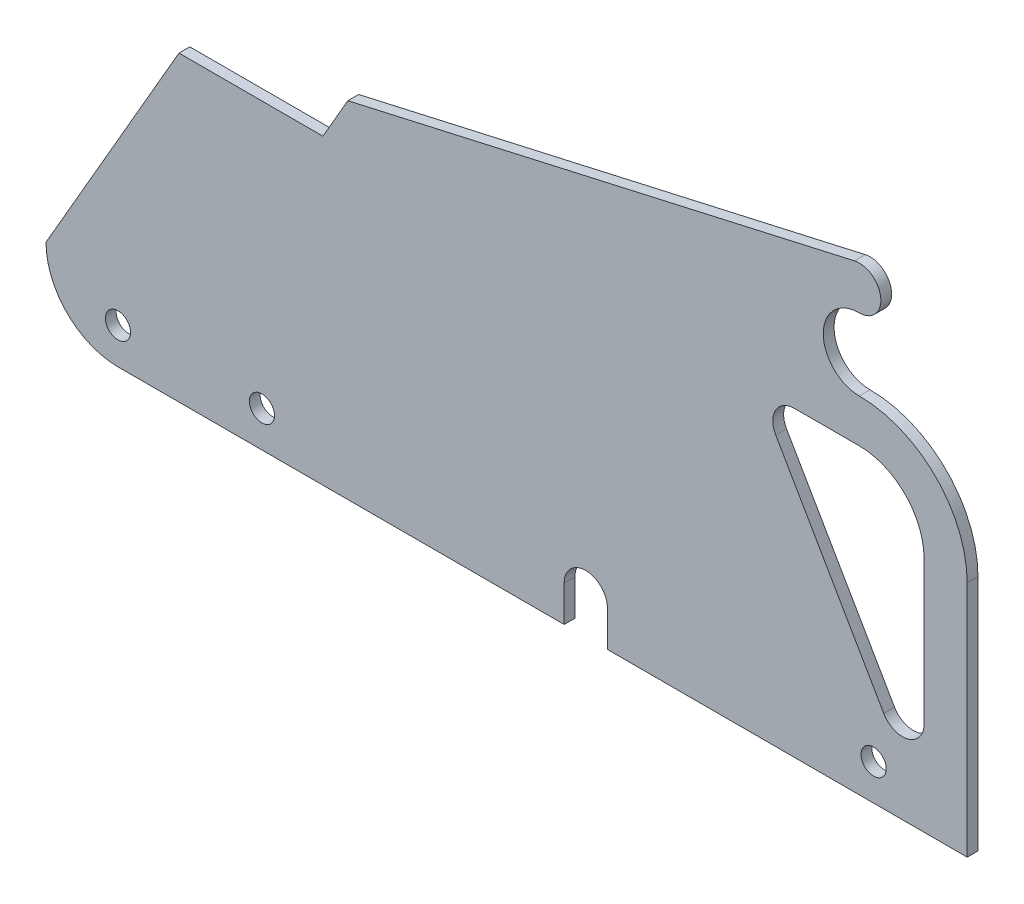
from build123d import *

# Parameters (mm, degrees)
SKETCH1_R      = 1.75
EXTRUDE1_DEPTH = 1.5


with BuildPart() as part:
    # Sketch1 → Extrude1 (new body)
    with BuildSketch(Plane.XY):
        with BuildLine():
            Line((0, 33), (0, 0))
            Line((0, 0), (-50, 0))
            Line((-50, 0), (-50, 5))
            ThreePointArc((-50, 5), (-53, 8), (-56, 5))
            Line((-56, 5), (-56, 0))
            Line((-56, 0), (-118, 0))
            ThreePointArc((-118, 0), (-125.071067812, 2.928932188), (-128, 10))
            Line((-128, 10), (-109.524791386, 42))
            Line((-109.524791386, 42), (-89.524791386, 42))
            Line((-89.524791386, 42), (-86.060689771, 48))
            Line((-86.060689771, 48), (-15.661951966, 63.926058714))
            ThreePointArc((-15.661951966, 63.926058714), (-12.018542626, 61.333034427), (-15, 58))
            ThreePointArc((-15, 58), (-20, 53), (-15, 48))
            ThreePointArc((-15, 48), (-4.393398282, 43.606601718), (0, 33))
        make_face()
        with Locations((-13, 5)):
            Circle(SKETCH1_R, mode=Mode.SUBTRACT)
        with Locations((-98, 5)):
            Circle(SKETCH1_R, mode=Mode.SUBTRACT)
        with Locations((-118, 5)):
            Circle(SKETCH1_R, mode=Mode.SUBTRACT)
        with BuildLine():
            Line((-6, 33), (-6, 13))
            ThreePointArc((-6, 13), (-8.223542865, 10.102222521), (-11.598076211, 11.5))
            Line((-11.598076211, 11.5), (-26.60918321, 37.5))
            ThreePointArc((-26.60918321, 37.5), (-26.60918321, 40.5), (-24.011106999, 42))
            Line((-24.011106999, 42), (-15, 42))
            ThreePointArc((-15, 42), (-8.636038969, 39.363961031), (-6, 33))
        make_face(mode=Mode.SUBTRACT)
    extrude(amount=EXTRUDE1_DEPTH)


solid = part.part
